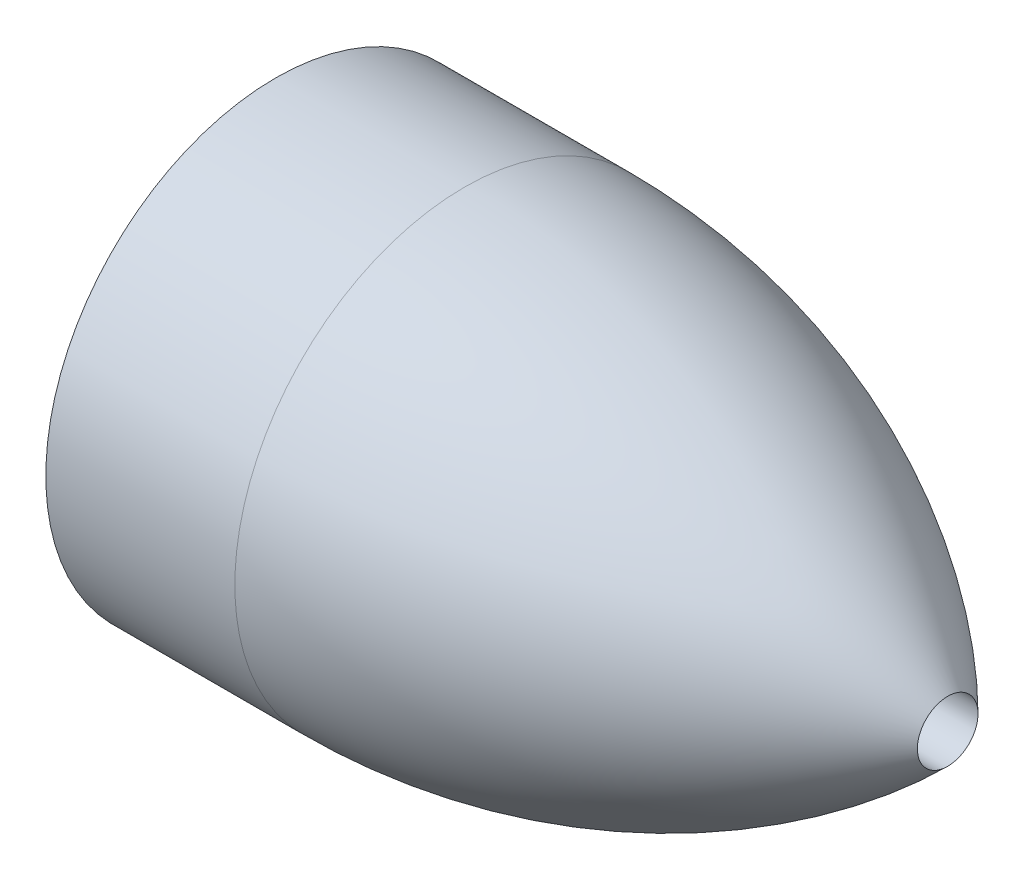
ISO-10303-21;
HEADER;
FILE_DESCRIPTION(('STEP AP214'),'2;1');
FILE_NAME('part.step','',(''),(''),'','','');
FILE_SCHEMA(('AUTOMOTIVE_DESIGN { 1 0 10303 214 1 1 1 1 }'));
ENDSEC;
DATA;
#1=APPLICATION_CONTEXT('core data for automotive mechanical design processes');
#2=APPLICATION_PROTOCOL_DEFINITION('international standard','automotive_design',2000,#1);
#3=PRODUCT_CONTEXT('',#1,'mechanical');
#4=PRODUCT('Part','Part','',(#3));
#5=PRODUCT_RELATED_PRODUCT_CATEGORY('part','',(#4));
#6=PRODUCT_DEFINITION_FORMATION('','',#4);
#7=PRODUCT_DEFINITION_CONTEXT('part definition',#1,'design');
#8=PRODUCT_DEFINITION('design','',#6,#7);
#9=PRODUCT_DEFINITION_SHAPE('','',#8);
#10=(LENGTH_UNIT() NAMED_UNIT(*) SI_UNIT(.MILLI.,.METRE.));
#11=(NAMED_UNIT(*) PLANE_ANGLE_UNIT() SI_UNIT($,.RADIAN.));
#12=(NAMED_UNIT(*) SI_UNIT($,.STERADIAN.) SOLID_ANGLE_UNIT());
#13=UNCERTAINTY_MEASURE_WITH_UNIT(LENGTH_MEASURE(1.E-05),#10,'distance_accuracy_value','');
#14=(GEOMETRIC_REPRESENTATION_CONTEXT(3) GLOBAL_UNCERTAINTY_ASSIGNED_CONTEXT((#13)) GLOBAL_UNIT_ASSIGNED_CONTEXT((#10,
#11,#12)) REPRESENTATION_CONTEXT('',''));
#15=CARTESIAN_POINT('',(0.,0.,0.));
#16=DIRECTION('',(0.,0.,1.));
#17=DIRECTION('',(1.,0.,0.));
#18=AXIS2_PLACEMENT_3D('',#15,#16,#17);
#19=CARTESIAN_POINT('',(85.0562269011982,0.,0.));
#20=DIRECTION('',(-1.,0.,0.));
#21=DIRECTION('',(0.,-1.,0.));
#22=AXIS2_PLACEMENT_3D('',#19,#20,#21);
#23=CONICAL_SURFACE('',#22,12.7,1.02974425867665);
#24=CARTESIAN_POINT('',(85.0562269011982,0.,0.));
#25=DIRECTION('',(1.,0.,0.));
#26=DIRECTION('',(0.,1.,0.));
#27=AXIS2_PLACEMENT_3D('',#24,#25,#26);
#28=CIRCLE('',#27,12.7);
#29=CARTESIAN_POINT('',(85.0562269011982,12.7,0.));
#30=VERTEX_POINT('',#29);
#31=EDGE_CURVE('E65',#30,#30,#28,.T.);
#32=ORIENTED_EDGE('',*,*,#31,.F.);
#33=EDGE_LOOP('',(#32));
#34=FACE_BOUND('',#33,.T.);
#35=CARTESIAN_POINT('',(89.9832639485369,0.,0.));
#36=DIRECTION('',(-1.,0.,0.));
#37=DIRECTION('',(0.,-1.,0.));
#38=AXIS2_PLACEMENT_3D('',#35,#36,#37);
#39=CIRCLE('',#38,4.50003333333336);
#40=CARTESIAN_POINT('',(89.9832639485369,-4.50003333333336,0.));
#41=VERTEX_POINT('',#40);
#42=EDGE_CURVE('E40',#41,#41,#39,.F.);
#43=ORIENTED_EDGE('',*,*,#42,.T.);
#44=EDGE_LOOP('',(#43));
#45=FACE_BOUND('',#44,.T.);
#46=ADVANCED_FACE('F36',(#34,#45),#23,.F.);
#47=CARTESIAN_POINT('',(28.0469866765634,0.,0.));
#48=DIRECTION('',(1.,0.,0.));
#49=DIRECTION('',(0.,1.,0.));
#50=AXIS2_PLACEMENT_3D('',#47,#48,#49);
#51=DEGENERATE_TOROIDAL_SURFACE('',#50,67.5005,101.6,.F.);
#52=CARTESIAN_POINT('',(28.0469866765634,0.,0.));
#53=DIRECTION('',(1.,0.,0.));
#54=DIRECTION('',(0.,1.,0.));
#55=AXIS2_PLACEMENT_3D('',#52,#53,#54);
#56=CIRCLE('',#55,34.0995);
#57=CARTESIAN_POINT('',(28.0469866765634,34.0995,0.));
#58=VERTEX_POINT('',#57);
#59=EDGE_CURVE('E10',#58,#58,#56,.T.);
#60=ORIENTED_EDGE('',*,*,#59,.T.);
#61=EDGE_LOOP('',(#60));
#62=FACE_BOUND('',#61,.T.);
#63=CARTESIAN_POINT('',(99.7302008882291,0.,0.));
#64=DIRECTION('',(-1.,0.,0.));
#65=DIRECTION('',(0.,-1.,0.));
#66=AXIS2_PLACEMENT_3D('',#63,#64,#65);
#67=CIRCLE('',#66,4.50003333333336);
#68=CARTESIAN_POINT('',(99.7302008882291,-4.50003333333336,0.));
#69=VERTEX_POINT('',#68);
#70=EDGE_CURVE('E68',#69,#69,#67,.T.);
#71=ORIENTED_EDGE('',*,*,#70,.T.);
#72=EDGE_LOOP('',(#71));
#73=FACE_BOUND('',#72,.T.);
#74=ADVANCED_FACE('F38',(#62,#73),#51,.F.);
#75=CARTESIAN_POINT('',(101.6,0.,0.));
#76=DIRECTION('',(1.,0.,0.));
#77=DIRECTION('',(0.,1.,0.));
#78=AXIS2_PLACEMENT_3D('',#75,#76,#77);
#79=CYLINDRICAL_SURFACE('',#78,34.0995);
#80=CARTESIAN_POINT('',(0.,0.,0.));
#81=DIRECTION('',(1.,0.,0.));
#82=DIRECTION('',(0.,1.,0.));
#83=AXIS2_PLACEMENT_3D('',#80,#81,#82);
#84=CIRCLE('',#83,34.0995);
#85=CARTESIAN_POINT('',(0.,34.0995,0.));
#86=VERTEX_POINT('',#85);
#87=EDGE_CURVE('E44',#86,#86,#84,.T.);
#88=ORIENTED_EDGE('',*,*,#87,.T.);
#89=EDGE_LOOP('',(#88));
#90=FACE_BOUND('',#89,.T.);
#91=ORIENTED_EDGE('',*,*,#59,.F.);
#92=EDGE_LOOP('',(#91));
#93=FACE_BOUND('',#92,.T.);
#94=ADVANCED_FACE('F93',(#90,#93),#79,.T.);
#95=CARTESIAN_POINT('',(0.,-171.265149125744,0.));
#96=DIRECTION('',(1.,0.,0.));
#97=DIRECTION('',(0.,1.,0.));
#98=AXIS2_PLACEMENT_3D('',#95,#96,#97);
#99=PLANE('',#98);
#100=ORIENTED_EDGE('',*,*,#87,.F.);
#101=EDGE_LOOP('',(#100));
#102=FACE_BOUND('',#101,.T.);
#103=CARTESIAN_POINT('',(0.,0.,0.));
#104=DIRECTION('',(1.,0.,0.));
#105=DIRECTION('',(0.,1.,0.));
#106=AXIS2_PLACEMENT_3D('',#103,#104,#105);
#107=CIRCLE('',#106,29.337);
#108=CARTESIAN_POINT('',(0.,29.337,0.));
#109=VERTEX_POINT('',#108);
#110=EDGE_CURVE('E48',#109,#109,#107,.T.);
#111=ORIENTED_EDGE('',*,*,#110,.T.);
#112=EDGE_LOOP('',(#111));
#113=FACE_BOUND('',#112,.T.);
#114=ADVANCED_FACE('F110',(#102,#113),#99,.F.);
#115=CARTESIAN_POINT('',(101.6,0.,0.));
#116=DIRECTION('',(1.,0.,0.));
#117=DIRECTION('',(0.,1.,0.));
#118=AXIS2_PLACEMENT_3D('',#115,#116,#117);
#119=CYLINDRICAL_SURFACE('',#118,29.337);
#120=CARTESIAN_POINT('',(41.275,0.,0.));
#121=DIRECTION('',(1.,0.,0.));
#122=DIRECTION('',(0.,1.,0.));
#123=AXIS2_PLACEMENT_3D('',#120,#121,#122);
#124=CIRCLE('',#123,29.337);
#125=CARTESIAN_POINT('',(41.275,29.337,0.));
#126=VERTEX_POINT('',#125);
#127=EDGE_CURVE('E53',#126,#126,#124,.T.);
#128=ORIENTED_EDGE('',*,*,#127,.T.);
#129=EDGE_LOOP('',(#128));
#130=FACE_BOUND('',#129,.T.);
#131=ORIENTED_EDGE('',*,*,#110,.F.);
#132=EDGE_LOOP('',(#131));
#133=FACE_BOUND('',#132,.T.);
#134=ADVANCED_FACE('F106',(#130,#133),#119,.F.);
#135=CARTESIAN_POINT('',(41.275,0.,0.));
#136=DIRECTION('',(-1.,0.,0.));
#137=DIRECTION('',(0.,-1.,0.));
#138=AXIS2_PLACEMENT_3D('',#135,#136,#137);
#139=CONICAL_SURFACE('',#138,29.337,1.02974425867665);
#140=CARTESIAN_POINT('',(45.5483207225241,0.,0.));
#141=DIRECTION('',(1.,0.,0.));
#142=DIRECTION('',(0.,1.,0.));
#143=AXIS2_PLACEMENT_3D('',#140,#141,#142);
#144=CIRCLE('',#143,22.225);
#145=CARTESIAN_POINT('',(45.5483207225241,22.225,0.));
#146=VERTEX_POINT('',#145);
#147=EDGE_CURVE('E56',#146,#146,#144,.T.);
#148=ORIENTED_EDGE('',*,*,#147,.T.);
#149=EDGE_LOOP('',(#148));
#150=FACE_BOUND('',#149,.T.);
#151=ORIENTED_EDGE('',*,*,#127,.F.);
#152=EDGE_LOOP('',(#151));
#153=FACE_BOUND('',#152,.T.);
#154=ADVANCED_FACE('F102',(#150,#153),#139,.F.);
#155=CARTESIAN_POINT('',(101.6,0.,0.));
#156=DIRECTION('',(1.,0.,0.));
#157=DIRECTION('',(0.,1.,0.));
#158=AXIS2_PLACEMENT_3D('',#155,#156,#157);
#159=CYLINDRICAL_SURFACE('',#158,22.225);
#160=CARTESIAN_POINT('',(67.5090851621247,0.,0.));
#161=DIRECTION('',(1.,0.,0.));
#162=DIRECTION('',(0.,1.,0.));
#163=AXIS2_PLACEMENT_3D('',#160,#161,#162);
#164=CIRCLE('',#163,22.225);
#165=CARTESIAN_POINT('',(67.5090851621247,22.225,0.));
#166=VERTEX_POINT('',#165);
#167=EDGE_CURVE('E59',#166,#166,#164,.T.);
#168=ORIENTED_EDGE('',*,*,#167,.T.);
#169=EDGE_LOOP('',(#168));
#170=FACE_BOUND('',#169,.T.);
#171=ORIENTED_EDGE('',*,*,#147,.F.);
#172=EDGE_LOOP('',(#171));
#173=FACE_BOUND('',#172,.T.);
#174=ADVANCED_FACE('F98',(#170,#173),#159,.F.);
#175=CARTESIAN_POINT('',(67.5090851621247,0.,0.));
#176=DIRECTION('',(-1.,0.,0.));
#177=DIRECTION('',(0.,-1.,0.));
#178=AXIS2_PLACEMENT_3D('',#175,#176,#177);
#179=CONICAL_SURFACE('',#178,22.225,1.02974425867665);
#180=CARTESIAN_POINT('',(73.2322825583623,0.,0.));
#181=DIRECTION('',(1.,0.,0.));
#182=DIRECTION('',(0.,1.,0.));
#183=AXIS2_PLACEMENT_3D('',#180,#181,#182);
#184=CIRCLE('',#183,12.7);
#185=CARTESIAN_POINT('',(73.2322825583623,12.7,0.));
#186=VERTEX_POINT('',#185);
#187=EDGE_CURVE('E62',#186,#186,#184,.T.);
#188=ORIENTED_EDGE('',*,*,#187,.T.);
#189=EDGE_LOOP('',(#188));
#190=FACE_BOUND('',#189,.T.);
#191=ORIENTED_EDGE('',*,*,#167,.F.);
#192=EDGE_LOOP('',(#191));
#193=FACE_BOUND('',#192,.T.);
#194=ADVANCED_FACE('F84',(#190,#193),#179,.F.);
#195=CARTESIAN_POINT('',(101.6,0.,0.));
#196=DIRECTION('',(1.,0.,0.));
#197=DIRECTION('',(0.,1.,0.));
#198=AXIS2_PLACEMENT_3D('',#195,#196,#197);
#199=CYLINDRICAL_SURFACE('',#198,12.7);
#200=ORIENTED_EDGE('',*,*,#31,.T.);
#201=EDGE_LOOP('',(#200));
#202=FACE_BOUND('',#201,.T.);
#203=ORIENTED_EDGE('',*,*,#187,.F.);
#204=EDGE_LOOP('',(#203));
#205=FACE_BOUND('',#204,.T.);
#206=ADVANCED_FACE('F78',(#202,#205),#199,.F.);
#207=CARTESIAN_POINT('',(101.6,0.,0.));
#208=DIRECTION('',(-1.,0.,0.));
#209=DIRECTION('',(0.,0.,1.));
#210=AXIS2_PLACEMENT_3D('',#207,#208,#209);
#211=CYLINDRICAL_SURFACE('',#210,4.50003333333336);
#212=ORIENTED_EDGE('',*,*,#70,.F.);
#213=EDGE_LOOP('',(#212));
#214=FACE_BOUND('',#213,.T.);
#215=ORIENTED_EDGE('',*,*,#42,.F.);
#216=EDGE_LOOP('',(#215));
#217=FACE_BOUND('',#216,.T.);
#218=ADVANCED_FACE('F76',(#214,#217),#211,.F.);
#219=CLOSED_SHELL('',(#46,#74,#94,#114,#134,#154,#174,#194,#206,#218));
#220=MANIFOLD_SOLID_BREP('B2',#219);
#221=ADVANCED_BREP_SHAPE_REPRESENTATION('',(#18,#220),#14);
#222=SHAPE_DEFINITION_REPRESENTATION(#9,#221);
ENDSEC;
END-ISO-10303-21;
